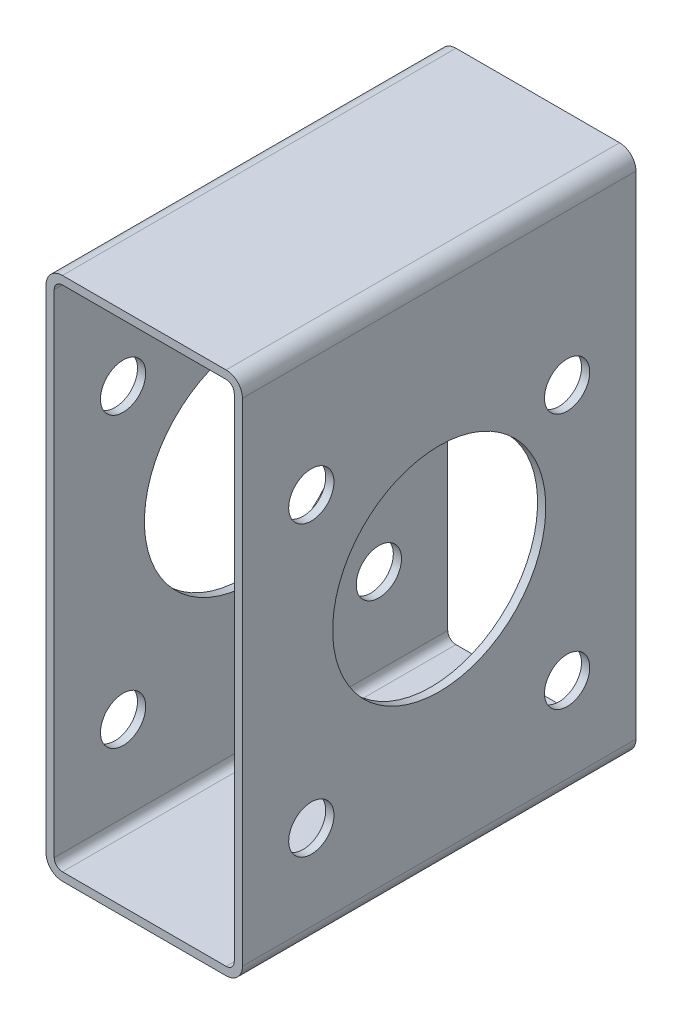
from build123d import *

# Parameters (mm, degrees)
CHANNEL_DEPTH = 152.4
HOLES1_REACH  = 207.128
SKETCH2_R     = 41.275
SKETCH2_R_2   = 8.763
HOLES2_REACH  = 207.128
SKETCH4_R     = 41.275
SKETCH4_R_2   = 8.763


with BuildPart() as part:
    # Sketch1 → CHANNEL (new body)
    with BuildSketch(Plane.XY):
        with BuildLine():
            Line((-31.75, -88.9), (31.623, -88.9))
            ThreePointArc((31.623, -88.9), (36.113128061, -87.040128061), (37.973, -82.55))
            Line((37.973, -82.55), (37.973, 107.95))
            ThreePointArc((37.973, 107.95), (36.113128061, 112.440128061), (31.623, 114.3))
            Line((31.623, 114.3), (-31.75, 114.3))
            ThreePointArc((-31.75, 114.3), (-36.240128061, 112.440128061), (-38.1, 107.95))
            Line((-38.1, 107.95), (-38.1, -82.55))
            ThreePointArc((-38.1, -82.55), (-36.240128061, -87.040128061), (-31.75, -88.9))
        make_face()
        with BuildLine():
            Line((-34.925, -82.55), (-34.925, 107.95))
            ThreePointArc((-34.925, 107.95), (-33.99506403, 110.19506403), (-31.75, 111.125))
            Line((-31.75, 111.125), (31.623, 111.125))
            ThreePointArc((31.623, 111.125), (33.86806403, 110.19506403), (34.798, 107.95))
            Line((34.798, 107.95), (34.798, -82.55))
            ThreePointArc((34.798, -82.55), (33.86806403, -84.79506403), (31.623, -85.725))
            Line((31.623, -85.725), (-31.75, -85.725))
            ThreePointArc((-31.75, -85.725), (-33.99506403, -84.79506403), (-34.925, -82.55))
        make_face(mode=Mode.SUBTRACT)
    extrude(amount=CHANNEL_DEPTH)

    # Sketch2 → HOLES1 (cut, up to next)
    with BuildSketch(Plane(origin=(37.973, 0, 0), x_dir=(0, 0, -1), z_dir=(1, 0, 0)), mode=Mode.PRIVATE) as holes1_sk1:
        with Locations(Location((-76.2, 12.7, 0), (0, 0, 90))):
            Circle(SKETCH2_R)
    holes1_tool1 = extrude(holes1_sk1.sketch, amount=-HOLES1_REACH, mode=Mode.PRIVATE) & part.part
    # Sketch2 → HOLES1 (cut, up to next)
    with BuildSketch(Plane(origin=(37.973, 0, 0), x_dir=(0, 0, -1), z_dir=(1, 0, 0)), mode=Mode.PRIVATE) as holes1_sk2:
        with Locations(Location((-125.73, 62.23, 0), (0, 0, 90))):
            Circle(SKETCH2_R_2)
    holes1_tool2 = extrude(holes1_sk2.sketch, amount=-HOLES1_REACH, mode=Mode.PRIVATE) & part.part
    # Sketch2 → HOLES1 (cut, up to next)
    with BuildSketch(Plane(origin=(37.973, 0, 0), x_dir=(0, 0, -1), z_dir=(1, 0, 0)), mode=Mode.PRIVATE) as holes1_sk3:
        with Locations(Location((-26.67, 49.53, 0), (0, 0, 90))):
            Circle(SKETCH2_R_2)
    holes1_tool3 = extrude(holes1_sk3.sketch, amount=-HOLES1_REACH, mode=Mode.PRIVATE) & part.part
    # Sketch2 → HOLES1 (cut, up to next)
    with BuildSketch(Plane(origin=(37.973, 0, 0), x_dir=(0, 0, -1), z_dir=(1, 0, 0)), mode=Mode.PRIVATE) as holes1_sk4:
        with Locations(Location((-26.67, -49.53, 0), (0, 0, 90))):
            Circle(SKETCH2_R_2)
    holes1_tool4 = extrude(holes1_sk4.sketch, amount=-HOLES1_REACH, mode=Mode.PRIVATE) & part.part
    # Sketch2 → HOLES1 (cut, up to next)
    with BuildSketch(Plane(origin=(37.973, 0, 0), x_dir=(0, 0, -1), z_dir=(1, 0, 0)), mode=Mode.PRIVATE) as holes1_sk5:
        with Locations(Location((-125.73, -49.53, 0), (0, 0, 90))):
            Circle(SKETCH2_R_2)
    holes1_tool5 = extrude(holes1_sk5.sketch, amount=-HOLES1_REACH, mode=Mode.PRIVATE) & part.part
    add(holes1_tool1.solids().sort_by_distance((37.973, 12.7, 76.2))[0], mode=Mode.SUBTRACT)
    add(holes1_tool2.solids().sort_by_distance((37.973, 62.23, 125.73))[0], mode=Mode.SUBTRACT)
    add(holes1_tool3.solids().sort_by_distance((37.973, 49.53, 26.67))[0], mode=Mode.SUBTRACT)
    add(holes1_tool4.solids().sort_by_distance((37.973, -49.53, 26.67))[0], mode=Mode.SUBTRACT)
    add(holes1_tool5.solids().sort_by_distance((37.973, -49.53, 125.73))[0], mode=Mode.SUBTRACT)

    # Sketch4 → HOLES2 (cut, up to next)
    with BuildSketch(Plane.ZY.offset(38.1), mode=Mode.PRIVATE) as holes2_sk1:
        with Locations(Location((76.2, 12.7, 0), (0, 0, 90))):
            Circle(SKETCH4_R)
    holes2_tool1 = extrude(holes2_sk1.sketch, amount=-HOLES2_REACH, mode=Mode.PRIVATE) & part.part
    # Sketch4 → HOLES2 (cut, up to next)
    with BuildSketch(Plane.ZY.offset(38.1), mode=Mode.PRIVATE) as holes2_sk2:
        with Locations(Location((26.67, 49.53, 0), (0, 0, 90))):
            Circle(SKETCH4_R_2)
    holes2_tool2 = extrude(holes2_sk2.sketch, amount=-HOLES2_REACH, mode=Mode.PRIVATE) & part.part
    # Sketch4 → HOLES2 (cut, up to next)
    with BuildSketch(Plane.ZY.offset(38.1), mode=Mode.PRIVATE) as holes2_sk3:
        with Locations(Location((125.73, 62.23, 0), (0, 0, 90))):
            Circle(SKETCH4_R_2)
    holes2_tool3 = extrude(holes2_sk3.sketch, amount=-HOLES2_REACH, mode=Mode.PRIVATE) & part.part
    # Sketch4 → HOLES2 (cut, up to next)
    with BuildSketch(Plane.ZY.offset(38.1), mode=Mode.PRIVATE) as holes2_sk4:
        with Locations(Location((26.67, -49.53, 0), (0, 0, 90))):
            Circle(SKETCH4_R_2)
    holes2_tool4 = extrude(holes2_sk4.sketch, amount=-HOLES2_REACH, mode=Mode.PRIVATE) & part.part
    # Sketch4 → HOLES2 (cut, up to next)
    with BuildSketch(Plane.ZY.offset(38.1), mode=Mode.PRIVATE) as holes2_sk5:
        with Locations(Location((125.73, -49.53, 0), (0, 0, 90))):
            Circle(SKETCH4_R_2)
    holes2_tool5 = extrude(holes2_sk5.sketch, amount=-HOLES2_REACH, mode=Mode.PRIVATE) & part.part
    add(holes2_tool1.solids().sort_by_distance((-38.1, 12.7, 76.2))[0], mode=Mode.SUBTRACT)
    add(holes2_tool2.solids().sort_by_distance((-38.1, 49.53, 26.67))[0], mode=Mode.SUBTRACT)
    add(holes2_tool3.solids().sort_by_distance((-38.1, 62.23, 125.73))[0], mode=Mode.SUBTRACT)
    add(holes2_tool4.solids().sort_by_distance((-38.1, -49.53, 26.67))[0], mode=Mode.SUBTRACT)
    add(holes2_tool5.solids().sort_by_distance((-38.1, -49.53, 125.73))[0], mode=Mode.SUBTRACT)


solid = part.part
